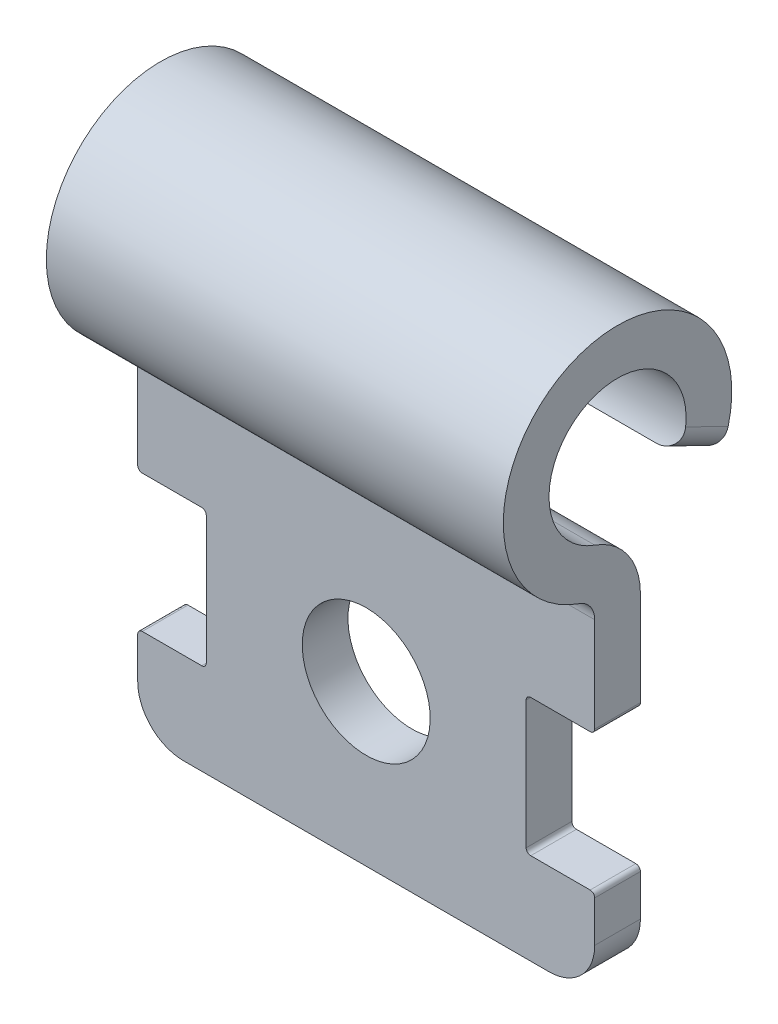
from build123d import *

# Parameters (mm, degrees)
EXTRUDE_THIN1_DEPTH = 10
SKETCH2_R           = 1.4
CUT_EXTRUDE1_DEPTH  = 15.456832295
SKETCH3_W           = 1.5
SKETCH3_H           = 3
CUT_EXTRUDE2_DEPTH  = 15.456832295
FILLET1_R           = 0.5
FILLET2_R           = 1
FILLET3_R           = 0.1


with BuildPart() as part:
    # Sketch1 → Extrude-Thin1 (new body)
    with BuildSketch(Plane(origin=(0, 0, 0), x_dir=(0, 0, -1), z_dir=(1, 0, 0))):
        with BuildLine():
            ThreePointArc((2.247022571, -1.095851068), (-0.947242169, 2.313597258), (-0.833333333, -2.357022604))
            ThreePointArc((-0.833333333, -2.357022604), (-0.59175171, -2.53975199), (-0.5, -2.828427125))
            Line((-0.5, -2.828427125), (-0.5, -10))
            Line((-0.5, -10), (0.5, -10))
            Line((0.5, -10), (0.5, -2.828427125))
            ThreePointArc((0.5, -2.828427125), (0.224744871, -1.962401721), (-0.5, -1.414213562))
            ThreePointArc((-0.5, -1.414213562), (-0.568345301, 1.388158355), (1.348213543, -0.657510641))
            Line((1.348213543, -0.657510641), (2.247022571, -1.095851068))
        make_face()
    extrude(amount=EXTRUDE_THIN1_DEPTH)

    # Sketch2 → Cut-Extrude1 (cut, through all)
    with BuildSketch(Plane(origin=(0, 0, -0.5), x_dir=(-1, 0, 0), z_dir=(0, 0, -1))):
        with Locations(Location((-5, -6.5, 0), (0, 0, 90))):
            Circle(SKETCH2_R)
    extrude(amount=-CUT_EXTRUDE1_DEPTH, mode=Mode.SUBTRACT)

    # Sketch3 → Cut-Extrude2 (cut, through all)
    with BuildSketch(Plane.XY.offset(0.5)):
        with Locations((0.75, -6.5)):
            Rectangle(SKETCH3_W, SKETCH3_H)
        with Locations((9.25, -6.5)):
            Rectangle(SKETCH3_W, SKETCH3_H)
    extrude(amount=-CUT_EXTRUDE2_DEPTH, mode=Mode.SUBTRACT)

    # Fillet1
    fillet1_edges = [part.edges().sort_by_distance(p)[0] for p in [
        (10, -0.876680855, -1.797618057),
        (0, -0.876680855, -1.797618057),
    ]]
    fillet(fillet1_edges, radius=FILLET1_R)

    # Fillet2
    fillet2_edges = [part.edges().sort_by_distance(p)[0] for p in [
        (10, -10, 0),
        (0, -10, 0),
    ]]
    fillet(fillet2_edges, radius=FILLET2_R)

    # Fillet3
    fillet3_edges = [part.edges().sort_by_distance(p)[0] for p in [
        (0, -8, 0),
        (0, -5, 0),
        (1.5, -5, 0),
        (1.5, -8, 0),
        (10, -5, 0),
        (10, -8, 0),
        (8.5, -8, 0),
        (8.5, -5, 0),
    ]]
    fillet(fillet3_edges, radius=FILLET3_R)


solid = part.part
